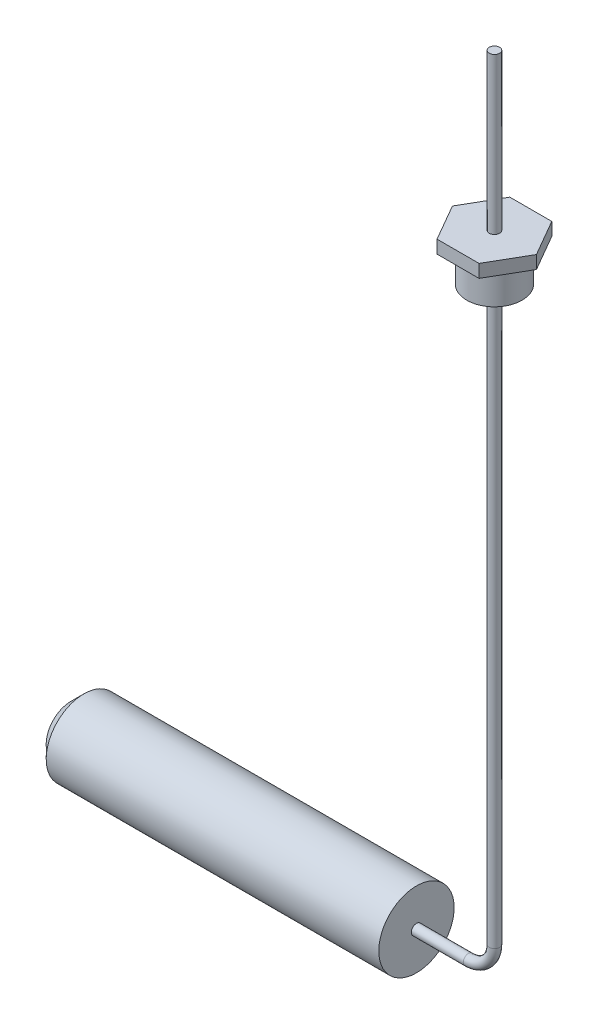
ISO-10303-21;
HEADER;
FILE_DESCRIPTION(('STEP AP214'),'2;1');
FILE_NAME('part.step','',(''),(''),'','','');
FILE_SCHEMA(('AUTOMOTIVE_DESIGN { 1 0 10303 214 1 1 1 1 }'));
ENDSEC;
DATA;
#1=APPLICATION_CONTEXT('core data for automotive mechanical design processes');
#2=APPLICATION_PROTOCOL_DEFINITION('international standard','automotive_design',2000,#1);
#3=PRODUCT_CONTEXT('',#1,'mechanical');
#4=PRODUCT('Part','Part','',(#3));
#5=PRODUCT_RELATED_PRODUCT_CATEGORY('part','',(#4));
#6=PRODUCT_DEFINITION_FORMATION('','',#4);
#7=PRODUCT_DEFINITION_CONTEXT('part definition',#1,'design');
#8=PRODUCT_DEFINITION('design','',#6,#7);
#9=PRODUCT_DEFINITION_SHAPE('','',#8);
#10=(LENGTH_UNIT() NAMED_UNIT(*) SI_UNIT(.MILLI.,.METRE.));
#11=(NAMED_UNIT(*) PLANE_ANGLE_UNIT() SI_UNIT($,.RADIAN.));
#12=(NAMED_UNIT(*) SI_UNIT($,.STERADIAN.) SOLID_ANGLE_UNIT());
#13=UNCERTAINTY_MEASURE_WITH_UNIT(LENGTH_MEASURE(1.E-05),#10,'distance_accuracy_value','');
#14=(GEOMETRIC_REPRESENTATION_CONTEXT(3) GLOBAL_UNCERTAINTY_ASSIGNED_CONTEXT((#13)) GLOBAL_UNIT_ASSIGNED_CONTEXT((#10,
#11,#12)) REPRESENTATION_CONTEXT('',''));
#15=CARTESIAN_POINT('',(0.,0.,0.));
#16=DIRECTION('',(0.,0.,1.));
#17=DIRECTION('',(1.,0.,0.));
#18=AXIS2_PLACEMENT_3D('',#15,#16,#17);
#19=CARTESIAN_POINT('',(-24.2487113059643,18.,-14.));
#20=DIRECTION('',(0.,-1.,0.));
#21=DIRECTION('',(0.,0.,-1.));
#22=AXIS2_PLACEMENT_3D('',#19,#20,#21);
#23=PLANE('',#22);
#24=DIRECTION('',(0.5,0.,0.866025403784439));
#25=VECTOR('',#24,1.);
#26=CARTESIAN_POINT('',(-16.1658075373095,18.,0.));
#27=LINE('',#26,#25);
#28=CARTESIAN_POINT('',(-16.1658075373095,18.,0.));
#29=VERTEX_POINT('',#28);
#30=CARTESIAN_POINT('',(-8.08290376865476,18.,14.));
#31=VERTEX_POINT('',#30);
#32=EDGE_CURVE('E127',#29,#31,#27,.T.);
#33=ORIENTED_EDGE('',*,*,#32,.T.);
#34=DIRECTION('',(1.,0.,0.));
#35=VECTOR('',#34,1.);
#36=CARTESIAN_POINT('',(-8.08290376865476,18.,14.));
#37=LINE('',#36,#35);
#38=CARTESIAN_POINT('',(8.08290376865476,18.,14.));
#39=VERTEX_POINT('',#38);
#40=EDGE_CURVE('E85',#31,#39,#37,.T.);
#41=ORIENTED_EDGE('',*,*,#40,.T.);
#42=DIRECTION('',(0.5,0.,-0.866025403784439));
#43=VECTOR('',#42,1.);
#44=CARTESIAN_POINT('',(8.08290376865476,18.,14.));
#45=LINE('',#44,#43);
#46=CARTESIAN_POINT('',(16.1658075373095,18.,0.));
#47=VERTEX_POINT('',#46);
#48=EDGE_CURVE('E98',#39,#47,#45,.T.);
#49=ORIENTED_EDGE('',*,*,#48,.T.);
#50=DIRECTION('',(-0.5,0.,-0.866025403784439));
#51=VECTOR('',#50,1.);
#52=CARTESIAN_POINT('',(16.1658075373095,18.,0.));
#53=LINE('',#52,#51);
#54=CARTESIAN_POINT('',(8.08290376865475,18.,-14.));
#55=VERTEX_POINT('',#54);
#56=EDGE_CURVE('E92',#47,#55,#53,.T.);
#57=ORIENTED_EDGE('',*,*,#56,.T.);
#58=DIRECTION('',(-1.,0.,0.));
#59=VECTOR('',#58,1.);
#60=CARTESIAN_POINT('',(8.08290376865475,18.,-14.));
#61=LINE('',#60,#59);
#62=CARTESIAN_POINT('',(-8.08290376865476,18.,-14.));
#63=VERTEX_POINT('',#62);
#64=EDGE_CURVE('E96',#55,#63,#61,.T.);
#65=ORIENTED_EDGE('',*,*,#64,.T.);
#66=DIRECTION('',(-0.5,0.,0.866025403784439));
#67=VECTOR('',#66,1.);
#68=CARTESIAN_POINT('',(-8.08290376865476,18.,-14.));
#69=LINE('',#68,#67);
#70=EDGE_CURVE('E47',#63,#29,#69,.T.);
#71=ORIENTED_EDGE('',*,*,#70,.T.);
#72=EDGE_LOOP('',(#33,#41,#49,#57,#65,#71));
#73=FACE_BOUND('',#72,.T.);
#74=CARTESIAN_POINT('',(0.,18.,0.));
#75=DIRECTION('',(0.,-1.,0.));
#76=DIRECTION('',(0.,0.,-1.));
#77=AXIS2_PLACEMENT_3D('',#74,#75,#76);
#78=CIRCLE('',#77,2.);
#79=CARTESIAN_POINT('',(0.,18.,-2.));
#80=VERTEX_POINT('',#79);
#81=EDGE_CURVE('E151',#80,#80,#78,.F.);
#82=ORIENTED_EDGE('',*,*,#81,.F.);
#83=EDGE_LOOP('',(#82));
#84=FACE_BOUND('',#83,.T.);
#85=ADVANCED_FACE('F30',(#73,#84),#23,.F.);
#86=CARTESIAN_POINT('',(-9.99999999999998,-230.,0.));
#87=DIRECTION('',(-1.,0.,0.));
#88=DIRECTION('',(0.,0.,1.));
#89=AXIS2_PLACEMENT_3D('',#86,#87,#88);
#90=CYLINDRICAL_SURFACE('',#89,2.);
#91=CARTESIAN_POINT('',(-9.99999999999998,-230.,0.));
#92=DIRECTION('',(1.,0.,0.));
#93=DIRECTION('',(0.,0.,1.));
#94=AXIS2_PLACEMENT_3D('',#91,#92,#93);
#95=CIRCLE('',#94,2.);
#96=CARTESIAN_POINT('',(-9.99999999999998,-232.,0.));
#97=VERTEX_POINT('',#96);
#98=EDGE_CURVE('E146',#97,#97,#95,.T.);
#99=ORIENTED_EDGE('',*,*,#98,.F.);
#100=EDGE_LOOP('',(#99));
#101=FACE_BOUND('',#100,.T.);
#102=CARTESIAN_POINT('',(-30.0000000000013,-230.,0.));
#103=DIRECTION('',(-1.,0.,0.));
#104=DIRECTION('',(0.,-1.,0.));
#105=AXIS2_PLACEMENT_3D('',#102,#103,#104);
#106=CIRCLE('',#105,2.);
#107=CARTESIAN_POINT('',(-30.0000000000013,-232.,0.));
#108=VERTEX_POINT('',#107);
#109=EDGE_CURVE('E222',#108,#108,#106,.T.);
#110=ORIENTED_EDGE('',*,*,#109,.F.);
#111=EDGE_LOOP('',(#110));
#112=FACE_BOUND('',#111,.T.);
#113=ADVANCED_FACE('F167',(#101,#112),#90,.T.);
#114=CARTESIAN_POINT('',(-9.99999999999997,-220.,0.));
#115=DIRECTION('',(0.,0.,-1.));
#116=DIRECTION('',(-1.,0.,0.));
#117=AXIS2_PLACEMENT_3D('',#114,#115,#116);
#118=TOROIDAL_SURFACE('',#117,10.,2.);
#119=CARTESIAN_POINT('',(0.,-220.,0.));
#120=DIRECTION('',(0.,1.,0.));
#121=DIRECTION('',(0.,0.,1.));
#122=AXIS2_PLACEMENT_3D('',#119,#120,#121);
#123=CIRCLE('',#122,2.);
#124=CARTESIAN_POINT('',(2.00000000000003,-220.,0.));
#125=VERTEX_POINT('',#124);
#126=EDGE_CURVE('E143',#125,#125,#123,.T.);
#127=CARTESIAN_POINT('',(-9.99999999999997,-220.,0.));
#128=DIRECTION('',(0.,0.,-1.));
#129=DIRECTION('',(-1.,0.,0.));
#130=AXIS2_PLACEMENT_3D('',#127,#128,#129);
#131=CIRCLE('',#130,12.);
#132=EDGE_CURVE('',#125,#97,#131,.T.);
#133=ORIENTED_EDGE('',*,*,#126,.F.);
#134=ORIENTED_EDGE('',*,*,#98,.T.);
#135=ORIENTED_EDGE('',*,*,#132,.T.);
#136=ORIENTED_EDGE('',*,*,#132,.F.);
#137=EDGE_LOOP('',(#133,#135,#134,#136));
#138=FACE_BOUND('',#137,.T.);
#139=ADVANCED_FACE('F172',(#138),#118,.T.);
#140=CARTESIAN_POINT('',(0.,-220.,0.));
#141=DIRECTION('',(0.,1.,0.));
#142=DIRECTION('',(-1.,0.,0.));
#143=AXIS2_PLACEMENT_3D('',#140,#141,#142);
#144=CYLINDRICAL_SURFACE('',#143,2.);
#145=ORIENTED_EDGE('',*,*,#126,.T.);
#146=EDGE_LOOP('',(#145));
#147=FACE_BOUND('',#146,.T.);
#148=CARTESIAN_POINT('',(0.,0.,0.));
#149=DIRECTION('',(0.,1.,0.));
#150=DIRECTION('',(0.,0.,1.));
#151=AXIS2_PLACEMENT_3D('',#148,#149,#150);
#152=CIRCLE('',#151,2.);
#153=CARTESIAN_POINT('',(0.,0.,2.));
#154=VERTEX_POINT('',#153);
#155=EDGE_CURVE('E140',#154,#154,#152,.T.);
#156=ORIENTED_EDGE('',*,*,#155,.F.);
#157=EDGE_LOOP('',(#156));
#158=FACE_BOUND('',#157,.T.);
#159=ADVANCED_FACE('F207',(#147,#158),#144,.T.);
#160=CARTESIAN_POINT('',(0.,13.,0.));
#161=DIRECTION('',(0.,-1.,0.));
#162=DIRECTION('',(0.,0.,-1.));
#163=AXIS2_PLACEMENT_3D('',#160,#161,#162);
#164=CYLINDRICAL_SURFACE('',#163,10.65);
#165=CARTESIAN_POINT('',(0.,13.,0.));
#166=DIRECTION('',(0.,1.,0.));
#167=DIRECTION('',(0.,0.,1.));
#168=AXIS2_PLACEMENT_3D('',#165,#166,#167);
#169=CIRCLE('',#168,10.65);
#170=CARTESIAN_POINT('',(0.,13.,-10.65));
#171=VERTEX_POINT('',#170);
#172=EDGE_CURVE('E137',#171,#171,#169,.T.);
#173=CARTESIAN_POINT('',(0.,0.,0.));
#174=DIRECTION('',(0.,1.,0.));
#175=DIRECTION('',(0.,0.,1.));
#176=AXIS2_PLACEMENT_3D('',#173,#174,#175);
#177=CIRCLE('',#176,10.65);
#178=CARTESIAN_POINT('',(0.,0.,-10.65));
#179=VERTEX_POINT('',#178);
#180=EDGE_CURVE('E136',#179,#179,#177,.T.);
#181=CARTESIAN_POINT('',(0.,13.,-10.65));
#182=CARTESIAN_POINT('',(0.,12.8645833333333,-10.65));
#183=CARTESIAN_POINT('',(0.,12.7291666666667,-10.65));
#184=CARTESIAN_POINT('',(0.,12.4583333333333,-10.65));
#185=CARTESIAN_POINT('',(0.,12.3229166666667,-10.65));
#186=CARTESIAN_POINT('',(0.,12.0520833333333,-10.65));
#187=CARTESIAN_POINT('',(0.,11.9166666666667,-10.65));
#188=CARTESIAN_POINT('',(0.,11.6458333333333,-10.65));
#189=CARTESIAN_POINT('',(0.,11.5104166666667,-10.65));
#190=CARTESIAN_POINT('',(0.,11.2395833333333,-10.65));
#191=CARTESIAN_POINT('',(0.,11.1041666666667,-10.65));
#192=CARTESIAN_POINT('',(0.,10.8333333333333,-10.65));
#193=CARTESIAN_POINT('',(0.,10.6979166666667,-10.65));
#194=CARTESIAN_POINT('',(0.,10.4270833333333,-10.65));
#195=CARTESIAN_POINT('',(0.,10.2916666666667,-10.65));
#196=CARTESIAN_POINT('',(0.,10.0208333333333,-10.65));
#197=CARTESIAN_POINT('',(0.,9.88541666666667,-10.65));
#198=CARTESIAN_POINT('',(0.,9.61458333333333,-10.65));
#199=CARTESIAN_POINT('',(0.,9.47916666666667,-10.65));
#200=CARTESIAN_POINT('',(0.,9.20833333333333,-10.65));
#201=CARTESIAN_POINT('',(0.,9.07291666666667,-10.65));
#202=CARTESIAN_POINT('',(0.,8.80208333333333,-10.65));
#203=CARTESIAN_POINT('',(0.,8.66666666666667,-10.65));
#204=CARTESIAN_POINT('',(0.,8.39583333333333,-10.65));
#205=CARTESIAN_POINT('',(0.,8.26041666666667,-10.65));
#206=CARTESIAN_POINT('',(0.,7.98958333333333,-10.65));
#207=CARTESIAN_POINT('',(0.,7.85416666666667,-10.65));
#208=CARTESIAN_POINT('',(0.,7.58333333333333,-10.65));
#209=CARTESIAN_POINT('',(0.,7.44791666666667,-10.65));
#210=CARTESIAN_POINT('',(0.,7.17708333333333,-10.65));
#211=CARTESIAN_POINT('',(0.,7.04166666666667,-10.65));
#212=CARTESIAN_POINT('',(0.,6.77083333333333,-10.65));
#213=CARTESIAN_POINT('',(0.,6.63541666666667,-10.65));
#214=CARTESIAN_POINT('',(0.,6.36458333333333,-10.65));
#215=CARTESIAN_POINT('',(0.,6.22916666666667,-10.65));
#216=CARTESIAN_POINT('',(0.,5.95833333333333,-10.65));
#217=CARTESIAN_POINT('',(0.,5.82291666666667,-10.65));
#218=CARTESIAN_POINT('',(0.,5.55208333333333,-10.65));
#219=CARTESIAN_POINT('',(0.,5.41666666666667,-10.65));
#220=CARTESIAN_POINT('',(0.,5.14583333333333,-10.65));
#221=CARTESIAN_POINT('',(0.,5.01041666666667,-10.65));
#222=CARTESIAN_POINT('',(0.,4.73958333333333,-10.65));
#223=CARTESIAN_POINT('',(0.,4.60416666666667,-10.65));
#224=CARTESIAN_POINT('',(0.,4.33333333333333,-10.65));
#225=CARTESIAN_POINT('',(0.,4.19791666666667,-10.65));
#226=CARTESIAN_POINT('',(0.,3.92708333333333,-10.65));
#227=CARTESIAN_POINT('',(0.,3.79166666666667,-10.65));
#228=CARTESIAN_POINT('',(0.,3.52083333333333,-10.65));
#229=CARTESIAN_POINT('',(0.,3.38541666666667,-10.65));
#230=CARTESIAN_POINT('',(0.,3.11458333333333,-10.65));
#231=CARTESIAN_POINT('',(0.,2.97916666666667,-10.65));
#232=CARTESIAN_POINT('',(0.,2.70833333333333,-10.65));
#233=CARTESIAN_POINT('',(0.,2.57291666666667,-10.65));
#234=CARTESIAN_POINT('',(0.,2.30208333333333,-10.65));
#235=CARTESIAN_POINT('',(0.,2.16666666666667,-10.65));
#236=CARTESIAN_POINT('',(0.,1.89583333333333,-10.65));
#237=CARTESIAN_POINT('',(0.,1.76041666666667,-10.65));
#238=CARTESIAN_POINT('',(0.,1.48958333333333,-10.65));
#239=CARTESIAN_POINT('',(0.,1.35416666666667,-10.65));
#240=CARTESIAN_POINT('',(0.,1.08333333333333,-10.65));
#241=CARTESIAN_POINT('',(0.,0.947916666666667,-10.65));
#242=CARTESIAN_POINT('',(0.,0.677083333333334,-10.65));
#243=CARTESIAN_POINT('',(0.,0.541666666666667,-10.65));
#244=CARTESIAN_POINT('',(0.,0.270833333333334,-10.65));
#245=CARTESIAN_POINT('',(0.,0.135416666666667,-10.65));
#246=CARTESIAN_POINT('',(0.,0.,-10.65));
#247=B_SPLINE_CURVE_WITH_KNOTS('',3,(#181,#182,#183,#184,#185,#186,#187,#188,#189,#190,#191,
#192,#193,#194,#195,#196,#197,#198,#199,#200,#201,#202,#203,#204,#205,#206,#207,#208,#209,#210,
#211,#212,#213,#214,#215,#216,#217,#218,#219,#220,#221,#222,#223,#224,#225,#226,#227,#228,#229,
#230,#231,#232,#233,#234,#235,#236,#237,#238,#239,#240,#241,#242,#243,#244,#245,#246),
.UNSPECIFIED.,.F.,.F.,(4,2,2,2,2,2,2,2,2,2,2,2,2,2,2,2,2,2,2,2,2,2,2,2,2,2,2,2,2,2,2,2,4),(0.,
0.406249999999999,0.812499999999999,1.21875,1.625,2.03125,2.4375,2.84375,3.25,3.65625,4.0625,
4.46875,4.875,5.28125,5.6875,6.09375,6.5,6.90625,7.3125,7.71875,8.125,8.53125,8.9375,9.34375,
9.75,10.15625,10.5625,10.96875,11.375,11.78125,12.1875,12.59375,13.),.UNSPECIFIED.);
#248=EDGE_CURVE('BSEAM203',#171,#179,#247,.T.);
#249=ORIENTED_EDGE('',*,*,#172,.F.);
#250=ORIENTED_EDGE('',*,*,#180,.T.);
#251=ORIENTED_EDGE('',*,*,#248,.T.);
#252=ORIENTED_EDGE('',*,*,#248,.F.);
#253=EDGE_LOOP('',(#249,#251,#250,#252));
#254=FACE_BOUND('',#253,.T.);
#255=ADVANCED_FACE('F203',(#254),#164,.T.);
#256=CARTESIAN_POINT('',(0.,0.,0.));
#257=DIRECTION('',(0.,1.,0.));
#258=DIRECTION('',(0.,0.,1.));
#259=AXIS2_PLACEMENT_3D('',#256,#257,#258);
#260=PLANE('',#259);
#261=ORIENTED_EDGE('',*,*,#155,.T.);
#262=EDGE_LOOP('',(#261));
#263=FACE_BOUND('',#262,.T.);
#264=ORIENTED_EDGE('',*,*,#180,.F.);
#265=EDGE_LOOP('',(#264));
#266=FACE_BOUND('',#265,.T.);
#267=ADVANCED_FACE('F182',(#263,#266),#260,.F.);
#268=CARTESIAN_POINT('',(-24.2487113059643,13.,-14.));
#269=DIRECTION('',(0.,-1.,0.));
#270=DIRECTION('',(0.,0.,-1.));
#271=AXIS2_PLACEMENT_3D('',#268,#269,#270);
#272=PLANE('',#271);
#273=DIRECTION('',(0.5,0.,0.866025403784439));
#274=VECTOR('',#273,1.);
#275=CARTESIAN_POINT('',(-16.1658075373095,13.,0.));
#276=LINE('',#275,#274);
#277=CARTESIAN_POINT('',(-16.1658075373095,13.,0.));
#278=VERTEX_POINT('',#277);
#279=CARTESIAN_POINT('',(-8.08290376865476,13.,14.));
#280=VERTEX_POINT('',#279);
#281=EDGE_CURVE('E116',#278,#280,#276,.T.);
#282=ORIENTED_EDGE('',*,*,#281,.F.);
#283=DIRECTION('',(-0.5,0.,0.866025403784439));
#284=VECTOR('',#283,1.);
#285=CARTESIAN_POINT('',(-8.08290376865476,13.,-14.));
#286=LINE('',#285,#284);
#287=CARTESIAN_POINT('',(-8.08290376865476,13.,-14.));
#288=VERTEX_POINT('',#287);
#289=EDGE_CURVE('E76',#288,#278,#286,.T.);
#290=ORIENTED_EDGE('',*,*,#289,.F.);
#291=DIRECTION('',(-1.,0.,0.));
#292=VECTOR('',#291,1.);
#293=CARTESIAN_POINT('',(8.08290376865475,13.,-14.));
#294=LINE('',#293,#292);
#295=CARTESIAN_POINT('',(8.08290376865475,13.,-14.));
#296=VERTEX_POINT('',#295);
#297=EDGE_CURVE('E70',#296,#288,#294,.T.);
#298=ORIENTED_EDGE('',*,*,#297,.F.);
#299=DIRECTION('',(-0.5,0.,-0.866025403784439));
#300=VECTOR('',#299,1.);
#301=CARTESIAN_POINT('',(16.1658075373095,13.,0.));
#302=LINE('',#301,#300);
#303=CARTESIAN_POINT('',(16.1658075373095,13.,0.));
#304=VERTEX_POINT('',#303);
#305=EDGE_CURVE('E106',#304,#296,#302,.T.);
#306=ORIENTED_EDGE('',*,*,#305,.F.);
#307=DIRECTION('',(0.5,0.,-0.866025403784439));
#308=VECTOR('',#307,1.);
#309=CARTESIAN_POINT('',(8.08290376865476,13.,14.));
#310=LINE('',#309,#308);
#311=CARTESIAN_POINT('',(8.08290376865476,13.,14.));
#312=VERTEX_POINT('',#311);
#313=EDGE_CURVE('E122',#312,#304,#310,.T.);
#314=ORIENTED_EDGE('',*,*,#313,.F.);
#315=DIRECTION('',(1.,0.,0.));
#316=VECTOR('',#315,1.);
#317=CARTESIAN_POINT('',(-8.08290376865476,13.,14.));
#318=LINE('',#317,#316);
#319=EDGE_CURVE('E119',#280,#312,#318,.T.);
#320=ORIENTED_EDGE('',*,*,#319,.F.);
#321=EDGE_LOOP('',(#282,#290,#298,#306,#314,#320));
#322=FACE_BOUND('',#321,.T.);
#323=ORIENTED_EDGE('',*,*,#172,.T.);
#324=EDGE_LOOP('',(#323));
#325=FACE_BOUND('',#324,.T.);
#326=ADVANCED_FACE('F178',(#322,#325),#272,.T.);
#327=CARTESIAN_POINT('',(-16.1658075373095,18.,0.));
#328=DIRECTION('',(0.866025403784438,0.,-0.5));
#329=DIRECTION('',(-0.5,0.,-0.866025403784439));
#330=AXIS2_PLACEMENT_3D('',#327,#328,#329);
#331=PLANE('',#330);
#332=ORIENTED_EDGE('',*,*,#281,.T.);
#333=DIRECTION('',(0.,-1.,0.));
#334=VECTOR('',#333,1.);
#335=CARTESIAN_POINT('',(-8.08290376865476,18.,14.));
#336=LINE('',#335,#334);
#337=EDGE_CURVE('E134',#31,#280,#336,.T.);
#338=ORIENTED_EDGE('',*,*,#337,.F.);
#339=ORIENTED_EDGE('',*,*,#32,.F.);
#340=DIRECTION('',(0.,-1.,0.));
#341=VECTOR('',#340,1.);
#342=CARTESIAN_POINT('',(-16.1658075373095,18.,0.));
#343=LINE('',#342,#341);
#344=EDGE_CURVE('E112',#29,#278,#343,.T.);
#345=ORIENTED_EDGE('',*,*,#344,.T.);
#346=EDGE_LOOP('',(#332,#338,#339,#345));
#347=FACE_BOUND('',#346,.T.);
#348=ADVANCED_FACE('F181',(#347),#331,.F.);
#349=CARTESIAN_POINT('',(-8.08290376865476,18.,14.));
#350=DIRECTION('',(0.,0.,-1.));
#351=DIRECTION('',(-1.,0.,0.));
#352=AXIS2_PLACEMENT_3D('',#349,#350,#351);
#353=PLANE('',#352);
#354=ORIENTED_EDGE('',*,*,#319,.T.);
#355=DIRECTION('',(0.,-1.,0.));
#356=VECTOR('',#355,1.);
#357=CARTESIAN_POINT('',(8.08290376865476,18.,14.));
#358=LINE('',#357,#356);
#359=EDGE_CURVE('E131',#39,#312,#358,.T.);
#360=ORIENTED_EDGE('',*,*,#359,.F.);
#361=ORIENTED_EDGE('',*,*,#40,.F.);
#362=ORIENTED_EDGE('',*,*,#337,.T.);
#363=EDGE_LOOP('',(#354,#360,#361,#362));
#364=FACE_BOUND('',#363,.T.);
#365=ADVANCED_FACE('F194',(#364),#353,.F.);
#366=CARTESIAN_POINT('',(8.08290376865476,18.,14.));
#367=DIRECTION('',(-0.866025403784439,0.,-0.5));
#368=DIRECTION('',(-0.5,0.,0.866025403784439));
#369=AXIS2_PLACEMENT_3D('',#366,#367,#368);
#370=PLANE('',#369);
#371=ORIENTED_EDGE('',*,*,#313,.T.);
#372=DIRECTION('',(0.,-1.,0.));
#373=VECTOR('',#372,1.);
#374=CARTESIAN_POINT('',(16.1658075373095,18.,0.));
#375=LINE('',#374,#373);
#376=EDGE_CURVE('E107',#47,#304,#375,.T.);
#377=ORIENTED_EDGE('',*,*,#376,.F.);
#378=ORIENTED_EDGE('',*,*,#48,.F.);
#379=ORIENTED_EDGE('',*,*,#359,.T.);
#380=EDGE_LOOP('',(#371,#377,#378,#379));
#381=FACE_BOUND('',#380,.T.);
#382=ADVANCED_FACE('F191',(#381),#370,.F.);
#383=CARTESIAN_POINT('',(16.1658075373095,18.,0.));
#384=DIRECTION('',(-0.866025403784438,0.,0.5));
#385=DIRECTION('',(0.5,0.,0.866025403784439));
#386=AXIS2_PLACEMENT_3D('',#383,#384,#385);
#387=PLANE('',#386);
#388=ORIENTED_EDGE('',*,*,#305,.T.);
#389=DIRECTION('',(0.,-1.,0.));
#390=VECTOR('',#389,1.);
#391=CARTESIAN_POINT('',(8.08290376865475,18.,-14.));
#392=LINE('',#391,#390);
#393=EDGE_CURVE('E103',#55,#296,#392,.T.);
#394=ORIENTED_EDGE('',*,*,#393,.F.);
#395=ORIENTED_EDGE('',*,*,#56,.F.);
#396=ORIENTED_EDGE('',*,*,#376,.T.);
#397=EDGE_LOOP('',(#388,#394,#395,#396));
#398=FACE_BOUND('',#397,.T.);
#399=ADVANCED_FACE('F104',(#398),#387,.F.);
#400=CARTESIAN_POINT('',(8.08290376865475,18.,-14.));
#401=DIRECTION('',(0.,0.,1.));
#402=DIRECTION('',(1.,0.,0.));
#403=AXIS2_PLACEMENT_3D('',#400,#401,#402);
#404=PLANE('',#403);
#405=ORIENTED_EDGE('',*,*,#297,.T.);
#406=DIRECTION('',(0.,-1.,0.));
#407=VECTOR('',#406,1.);
#408=CARTESIAN_POINT('',(-8.08290376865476,18.,-14.));
#409=LINE('',#408,#407);
#410=EDGE_CURVE('E108',#63,#288,#409,.T.);
#411=ORIENTED_EDGE('',*,*,#410,.F.);
#412=ORIENTED_EDGE('',*,*,#64,.F.);
#413=ORIENTED_EDGE('',*,*,#393,.T.);
#414=EDGE_LOOP('',(#405,#411,#412,#413));
#415=FACE_BOUND('',#414,.T.);
#416=ADVANCED_FACE('F110',(#415),#404,.F.);
#417=CARTESIAN_POINT('',(-8.08290376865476,18.,-14.));
#418=DIRECTION('',(0.866025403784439,0.,0.5));
#419=DIRECTION('',(0.5,0.,-0.866025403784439));
#420=AXIS2_PLACEMENT_3D('',#417,#418,#419);
#421=PLANE('',#420);
#422=ORIENTED_EDGE('',*,*,#289,.T.);
#423=ORIENTED_EDGE('',*,*,#344,.F.);
#424=ORIENTED_EDGE('',*,*,#70,.F.);
#425=ORIENTED_EDGE('',*,*,#410,.T.);
#426=EDGE_LOOP('',(#422,#423,#424,#425));
#427=FACE_BOUND('',#426,.T.);
#428=ADVANCED_FACE('F184',(#427),#421,.F.);
#429=CARTESIAN_POINT('',(0.,78.,0.));
#430=DIRECTION('',(0.,-1.,0.));
#431=DIRECTION('',(0.,0.,-1.));
#432=AXIS2_PLACEMENT_3D('',#429,#430,#431);
#433=CYLINDRICAL_SURFACE('',#432,2.);
#434=CARTESIAN_POINT('',(0.,78.,0.));
#435=DIRECTION('',(0.,1.,0.));
#436=DIRECTION('',(0.,0.,1.));
#437=AXIS2_PLACEMENT_3D('',#434,#435,#436);
#438=CIRCLE('',#437,2.);
#439=CARTESIAN_POINT('',(0.,78.,-2.));
#440=VERTEX_POINT('',#439);
#441=EDGE_CURVE('E120',#440,#440,#438,.T.);
#442=CARTESIAN_POINT('',(0.,78.,-2.));
#443=CARTESIAN_POINT('',(0.,77.375,-2.));
#444=CARTESIAN_POINT('',(0.,76.75,-2.));
#445=CARTESIAN_POINT('',(0.,75.5,-2.));
#446=CARTESIAN_POINT('',(0.,74.875,-2.));
#447=CARTESIAN_POINT('',(0.,73.625,-2.));
#448=CARTESIAN_POINT('',(0.,73.,-2.));
#449=CARTESIAN_POINT('',(0.,71.75,-2.));
#450=CARTESIAN_POINT('',(0.,71.125,-2.));
#451=CARTESIAN_POINT('',(0.,69.875,-2.));
#452=CARTESIAN_POINT('',(0.,69.25,-2.));
#453=CARTESIAN_POINT('',(0.,68.,-2.));
#454=CARTESIAN_POINT('',(0.,67.375,-2.));
#455=CARTESIAN_POINT('',(0.,66.125,-2.));
#456=CARTESIAN_POINT('',(0.,65.5,-2.));
#457=CARTESIAN_POINT('',(0.,64.25,-2.));
#458=CARTESIAN_POINT('',(0.,63.625,-2.));
#459=CARTESIAN_POINT('',(0.,62.375,-2.));
#460=CARTESIAN_POINT('',(0.,61.75,-2.));
#461=CARTESIAN_POINT('',(0.,60.5,-2.));
#462=CARTESIAN_POINT('',(0.,59.875,-2.));
#463=CARTESIAN_POINT('',(0.,58.625,-2.));
#464=CARTESIAN_POINT('',(0.,58.,-2.));
#465=CARTESIAN_POINT('',(0.,56.75,-2.));
#466=CARTESIAN_POINT('',(0.,56.125,-2.));
#467=CARTESIAN_POINT('',(0.,54.875,-2.));
#468=CARTESIAN_POINT('',(0.,54.25,-2.));
#469=CARTESIAN_POINT('',(0.,53.,-2.));
#470=CARTESIAN_POINT('',(0.,52.375,-2.));
#471=CARTESIAN_POINT('',(0.,51.125,-2.));
#472=CARTESIAN_POINT('',(0.,50.5,-2.));
#473=CARTESIAN_POINT('',(0.,49.25,-2.));
#474=CARTESIAN_POINT('',(0.,48.625,-2.));
#475=CARTESIAN_POINT('',(0.,47.375,-2.));
#476=CARTESIAN_POINT('',(0.,46.75,-2.));
#477=CARTESIAN_POINT('',(0.,45.5,-2.));
#478=CARTESIAN_POINT('',(0.,44.875,-2.));
#479=CARTESIAN_POINT('',(0.,43.625,-2.));
#480=CARTESIAN_POINT('',(0.,43.,-2.));
#481=CARTESIAN_POINT('',(0.,41.75,-2.));
#482=CARTESIAN_POINT('',(0.,41.125,-2.));
#483=CARTESIAN_POINT('',(0.,39.875,-2.));
#484=CARTESIAN_POINT('',(0.,39.25,-2.));
#485=CARTESIAN_POINT('',(0.,38.,-2.));
#486=CARTESIAN_POINT('',(0.,37.375,-2.));
#487=CARTESIAN_POINT('',(0.,36.125,-2.));
#488=CARTESIAN_POINT('',(0.,35.5,-2.));
#489=CARTESIAN_POINT('',(0.,34.25,-2.));
#490=CARTESIAN_POINT('',(0.,33.625,-2.));
#491=CARTESIAN_POINT('',(0.,32.375,-2.));
#492=CARTESIAN_POINT('',(0.,31.75,-2.));
#493=CARTESIAN_POINT('',(0.,30.5,-2.));
#494=CARTESIAN_POINT('',(0.,29.875,-2.));
#495=CARTESIAN_POINT('',(0.,28.625,-2.));
#496=CARTESIAN_POINT('',(0.,28.,-2.));
#497=CARTESIAN_POINT('',(0.,26.75,-2.));
#498=CARTESIAN_POINT('',(0.,26.125,-2.));
#499=CARTESIAN_POINT('',(0.,24.875,-2.));
#500=CARTESIAN_POINT('',(0.,24.25,-2.));
#501=CARTESIAN_POINT('',(0.,23.,-2.));
#502=CARTESIAN_POINT('',(0.,22.375,-2.));
#503=CARTESIAN_POINT('',(0.,21.125,-2.));
#504=CARTESIAN_POINT('',(0.,20.5,-2.));
#505=CARTESIAN_POINT('',(0.,19.25,-2.));
#506=CARTESIAN_POINT('',(0.,18.625,-2.));
#507=CARTESIAN_POINT('',(0.,18.,-2.));
#508=B_SPLINE_CURVE_WITH_KNOTS('',3,(#442,#443,#444,#445,#446,#447,#448,#449,#450,#451,#452,
#453,#454,#455,#456,#457,#458,#459,#460,#461,#462,#463,#464,#465,#466,#467,#468,#469,#470,#471,
#472,#473,#474,#475,#476,#477,#478,#479,#480,#481,#482,#483,#484,#485,#486,#487,#488,#489,#490,
#491,#492,#493,#494,#495,#496,#497,#498,#499,#500,#501,#502,#503,#504,#505,#506,#507),
.UNSPECIFIED.,.F.,.F.,(4,2,2,2,2,2,2,2,2,2,2,2,2,2,2,2,2,2,2,2,2,2,2,2,2,2,2,2,2,2,2,2,4),(0.,
1.875,3.75,5.62500000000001,7.50000000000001,9.37500000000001,11.25,13.125,15.,16.875,18.75,
20.625,22.5,24.375,26.25,28.125,30.,31.875,33.75,35.625,37.5,39.375,41.25,43.125,45.,46.875,
48.75,50.625,52.5,54.375,56.25,58.125,60.),.UNSPECIFIED.);
#509=EDGE_CURVE('BSEAM176',#440,#80,#508,.T.);
#510=ORIENTED_EDGE('',*,*,#441,.F.);
#511=ORIENTED_EDGE('',*,*,#81,.T.);
#512=ORIENTED_EDGE('',*,*,#509,.T.);
#513=ORIENTED_EDGE('',*,*,#509,.F.);
#514=EDGE_LOOP('',(#510,#512,#511,#513));
#515=FACE_BOUND('',#514,.T.);
#516=ADVANCED_FACE('F176',(#515),#433,.T.);
#517=CARTESIAN_POINT('',(0.,78.,0.));
#518=DIRECTION('',(0.,1.,0.));
#519=DIRECTION('',(0.,0.,1.));
#520=AXIS2_PLACEMENT_3D('',#517,#518,#519);
#521=PLANE('',#520);
#522=ORIENTED_EDGE('',*,*,#441,.T.);
#523=EDGE_LOOP('',(#522));
#524=FACE_BOUND('',#523,.T.);
#525=ADVANCED_FACE('F246',(#524),#521,.T.);
#526=CARTESIAN_POINT('',(-30.0000000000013,-230.,0.));
#527=DIRECTION('',(-1.,0.,0.));
#528=DIRECTION('',(0.,-1.,0.));
#529=AXIS2_PLACEMENT_3D('',#526,#527,#528);
#530=PLANE('',#529);
#531=CARTESIAN_POINT('',(-30.0000000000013,-230.,0.));
#532=DIRECTION('',(-1.,0.,0.));
#533=DIRECTION('',(0.,-1.,0.));
#534=AXIS2_PLACEMENT_3D('',#531,#532,#533);
#535=CIRCLE('',#534,14.5);
#536=CARTESIAN_POINT('',(-30.0000000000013,-244.5,0.));
#537=VERTEX_POINT('',#536);
#538=EDGE_CURVE('E224',#537,#537,#535,.T.);
#539=ORIENTED_EDGE('',*,*,#538,.F.);
#540=EDGE_LOOP('',(#539));
#541=FACE_BOUND('',#540,.T.);
#542=ORIENTED_EDGE('',*,*,#109,.T.);
#543=EDGE_LOOP('',(#542));
#544=FACE_BOUND('',#543,.T.);
#545=ADVANCED_FACE('F244',(#541,#544),#530,.F.);
#546=CARTESIAN_POINT('',(-163.000000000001,-229.999999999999,0.));
#547=DIRECTION('',(1.,0.,0.));
#548=DIRECTION('',(0.,1.,0.));
#549=AXIS2_PLACEMENT_3D('',#546,#547,#548);
#550=CYLINDRICAL_SURFACE('',#549,14.5);
#551=CARTESIAN_POINT('',(-158.000000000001,-229.999999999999,0.));
#552=DIRECTION('',(-1.,0.,0.));
#553=DIRECTION('',(0.,-1.,0.));
#554=AXIS2_PLACEMENT_3D('',#551,#552,#553);
#555=CIRCLE('',#554,14.5);
#556=CARTESIAN_POINT('',(-158.000000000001,-244.499999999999,0.));
#557=VERTEX_POINT('',#556);
#558=EDGE_CURVE('E11',#557,#557,#555,.F.);
#559=ORIENTED_EDGE('',*,*,#558,.T.);
#560=EDGE_LOOP('',(#559));
#561=FACE_BOUND('',#560,.T.);
#562=ORIENTED_EDGE('',*,*,#538,.T.);
#563=EDGE_LOOP('',(#562));
#564=FACE_BOUND('',#563,.T.);
#565=ADVANCED_FACE('F163',(#561,#564),#550,.T.);
#566=CARTESIAN_POINT('',(-163.000000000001,-229.999999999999,0.));
#567=DIRECTION('',(-1.,0.,0.));
#568=DIRECTION('',(0.,-1.,0.));
#569=AXIS2_PLACEMENT_3D('',#566,#567,#568);
#570=PLANE('',#569);
#571=CARTESIAN_POINT('',(-163.000000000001,-229.999999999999,0.));
#572=DIRECTION('',(-1.,0.,0.));
#573=DIRECTION('',(0.,-1.,0.));
#574=AXIS2_PLACEMENT_3D('',#571,#572,#573);
#575=CIRCLE('',#574,9.50000000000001);
#576=CARTESIAN_POINT('',(-163.000000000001,-239.499999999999,0.));
#577=VERTEX_POINT('',#576);
#578=EDGE_CURVE('E39',#577,#577,#575,.T.);
#579=ORIENTED_EDGE('',*,*,#578,.T.);
#580=EDGE_LOOP('',(#579));
#581=FACE_BOUND('',#580,.T.);
#582=ADVANCED_FACE('F156',(#581),#570,.T.);
#583=CARTESIAN_POINT('',(-163.000000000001,-229.999999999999,0.));
#584=DIRECTION('',(1.,0.,0.));
#585=DIRECTION('',(0.,1.,0.));
#586=AXIS2_PLACEMENT_3D('',#583,#584,#585);
#587=CONICAL_SURFACE('',#586,9.50000000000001,0.785398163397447);
#588=ORIENTED_EDGE('',*,*,#558,.F.);
#589=EDGE_LOOP('',(#588));
#590=FACE_BOUND('',#589,.T.);
#591=ORIENTED_EDGE('',*,*,#578,.F.);
#592=EDGE_LOOP('',(#591));
#593=FACE_BOUND('',#592,.T.);
#594=ADVANCED_FACE('F32',(#590,#593),#587,.T.);
#595=CLOSED_SHELL('',(#85,#113,#139,#159,#255,#267,#326,#348,#365,#382,#399,#416,#428,#516,#525,
#545,#565,#582,#594));
#596=MANIFOLD_SOLID_BREP('B2',#595);
#597=ADVANCED_BREP_SHAPE_REPRESENTATION('',(#18,#596),#14);
#598=SHAPE_DEFINITION_REPRESENTATION(#9,#597);
ENDSEC;
END-ISO-10303-21;
